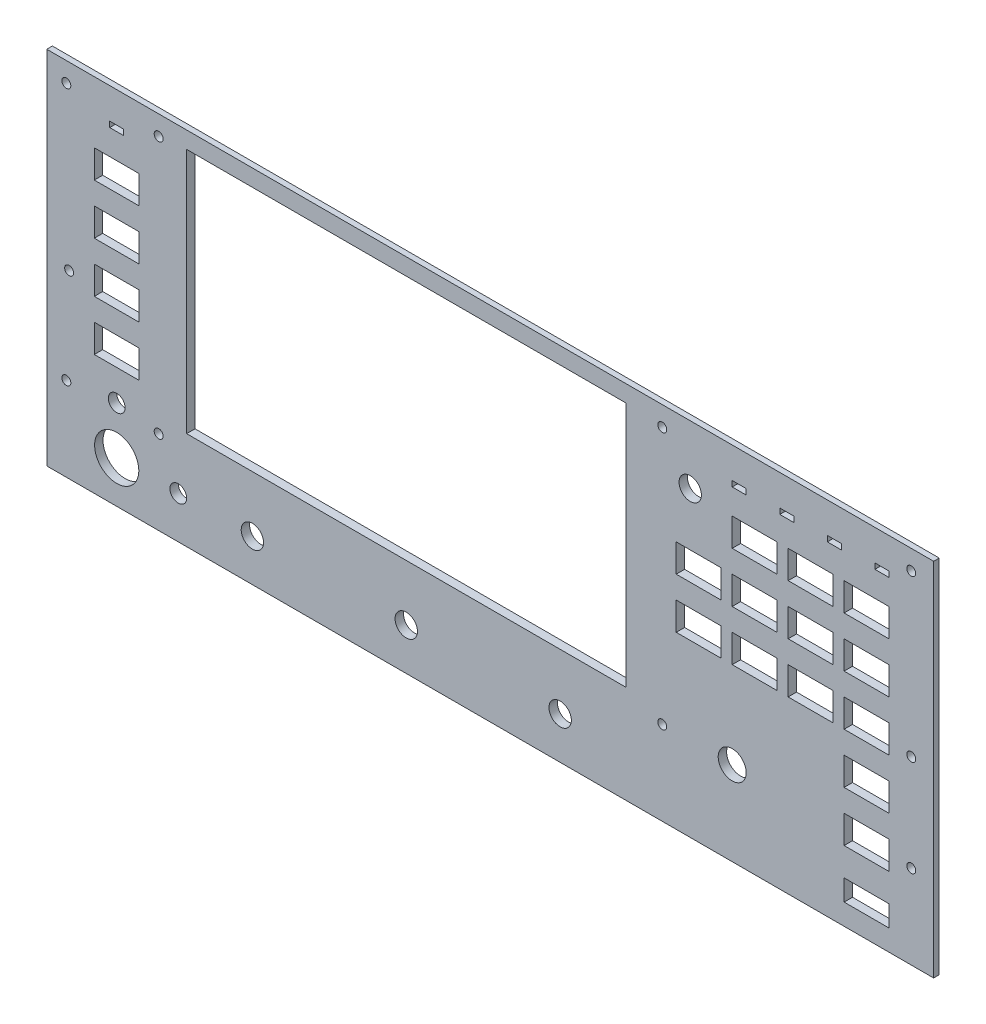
from build123d import *

# Parameters (mm, degrees)
SKETCH1_W            = 317
SKETCH1_H            = 129
BOSS_EXTRUDE1_DEPTH  = 3
SKETCH2_R            = 1.6
MOUNTING_HOLES_DEPTH = 172.14759712
TFT_R                = 1.6
TFT_W                = 157
TFT_H                = 88
DISPLAY_PCB_DEPTH    = 172.14759712
SKETCH3_R            = 5
SKETCH3_R_2          = 4
SKETCH3_R_3          = 7.9
SKETCH3_R_4          = 3
SKETCH3_W            = 5
SKETCH3_H            = 2
SKETCH3_W_2          = 16
SKETCH3_H_2          = 10
SKETCH3_H_3          = 7.5
CUTOUTS_DEPTH        = 172.14759712
SKETCH4_W            = 317
SKETCH4_H            = 129
SKETCH4_W_2          = 307
SKETCH4_H_2          = 119
CUT_EXTRUDE1_DEPTH   = 1


with BuildPart() as part:
    # Sketch1 → Boss-Extrude1 (new body)
    with BuildSketch(Plane.XY):
        Rectangle(SKETCH1_W, SKETCH1_H)
    extrude(amount=BOSS_EXTRUDE1_DEPTH)

    # Sketch2 → Mounting holes (cut, through all)
    with BuildSketch(Plane.XY.offset(3)):
        with Locations((-150.5, 0)):
            Circle(SKETCH2_R)
        with Locations((150.5, 0)):
            Circle(SKETCH2_R)
    extrude(amount=-MOUNTING_HOLES_DEPTH, mode=Mode.SUBTRACT)

    # TFT → Display _ PCB (cut, through all)
    with BuildSketch(Plane.XY.offset(3)):
        with Locations((-118.5, -34.5)):
            Circle(TFT_R)
        with Locations((61.5, -34.5)):
            Circle(TFT_R)
        with Locations((61.5, 57.5)):
            Circle(TFT_R)
        with Locations((-118.5, 57.5)):
            Circle(TFT_R)
        with Locations((-151.5, -34.5)):
            Circle(TFT_R)
        with Locations((-151.5, 57.5)):
            Circle(TFT_R)
        with Locations((175.029065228, 44.825269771)):
            Circle(TFT_R)
        with Locations((150.5, -34.5)):
            Circle(TFT_R)
        with Locations((150.5, 57.5)):
            Circle(TFT_R)
        with Locations((-30, 14.5)):
            Rectangle(TFT_W, TFT_H)
    extrude(amount=-DISPLAY_PCB_DEPTH, mode=Mode.SUBTRACT)

    # Sketch3 → Cutouts (cut, through all)
    with BuildSketch(Plane.XY.offset(3)):
        with Locations((86.5, -34.5)):
            Circle(SKETCH3_R)
        with Locations((-85, -49.5)):
            Circle(SKETCH3_R_2)
        with Locations((-30, -49.5)):
            Circle(SKETCH3_R_2)
        with Locations((25, -49.5)):
            Circle(SKETCH3_R_2)
        with Locations((71.5, 43.5)):
            Circle(SKETCH3_R_2)
        with Locations((-133.5, -49.5)):
            Circle(SKETCH3_R_3)
        with Locations((-133.5, -32.5)):
            Circle(SKETCH3_R_4)
        with Locations((-111.5, -49.5)):
            Circle(SKETCH3_R_4)
        with Locations((106, 52.5)):
            Rectangle(SKETCH3_W, SKETCH3_H)
        with Locations((134.5, -34.5)):
            Rectangle(SKETCH3_W_2, SKETCH3_H_2)
        with Locations((89, 52.5)):
            Rectangle(SKETCH3_W, SKETCH3_H)
        with Locations((-133.5, 19.5)):
            Rectangle(SKETCH3_W_2, SKETCH3_H_2)
        with Locations((-133.5, 1.5)):
            Rectangle(SKETCH3_W_2, SKETCH3_H_2)
        with Locations((-133.5, -16.5)):
            Rectangle(SKETCH3_W_2, SKETCH3_H_2)
        with Locations((-133.5, 37.5)):
            Rectangle(SKETCH3_W_2, SKETCH3_H_2)
        with Locations((123, 52.5)):
            Rectangle(SKETCH3_W, SKETCH3_H)
        with Locations((140, 52.5)):
            Rectangle(SKETCH3_W, SKETCH3_H)
        with Locations((-133.5, 52.5)):
            Rectangle(SKETCH3_W, SKETCH3_H)
        with Locations((134.5, -53.25)):
            Rectangle(SKETCH3_W_2, SKETCH3_H_3)
        with Locations((114.5, 1.5)):
            Rectangle(SKETCH3_W_2, SKETCH3_H_2)
        with Locations((94.5, 1.5)):
            Rectangle(SKETCH3_W_2, SKETCH3_H_2)
        with Locations((74.5, 1.5)):
            Rectangle(SKETCH3_W_2, SKETCH3_H_2)
        with Locations((114.5, 19.5)):
            Rectangle(SKETCH3_W_2, SKETCH3_H_2)
        with Locations((94.5, 19.5)):
            Rectangle(SKETCH3_W_2, SKETCH3_H_2)
        with Locations((74.5, 19.5)):
            Rectangle(SKETCH3_W_2, SKETCH3_H_2)
        with Locations((114.5, 37.5)):
            Rectangle(SKETCH3_W_2, SKETCH3_H_2)
        with Locations((94.5, 37.5)):
            Rectangle(SKETCH3_W_2, SKETCH3_H_2)
        with Locations((134.5, -16.5)):
            Rectangle(SKETCH3_W_2, SKETCH3_H_2)
        with Locations((134.5, 1.5)):
            Rectangle(SKETCH3_W_2, SKETCH3_H_2)
        with Locations((134.5, 19.5)):
            Rectangle(SKETCH3_W_2, SKETCH3_H_2)
        with Locations((134.5, 37.5)):
            Rectangle(SKETCH3_W_2, SKETCH3_H_2)
    extrude(amount=-CUTOUTS_DEPTH, mode=Mode.SUBTRACT)

    # Sketch4 → Cut-Extrude1 (cut)
    with BuildSketch(Plane(origin=(0, 0, 0), x_dir=(-1, 0, 0), z_dir=(0, 0, -1))):
        Rectangle(SKETCH4_W, SKETCH4_H)
        Rectangle(SKETCH4_W_2, SKETCH4_H_2, mode=Mode.SUBTRACT)
    extrude(amount=-CUT_EXTRUDE1_DEPTH, mode=Mode.SUBTRACT)


solid = part.part
